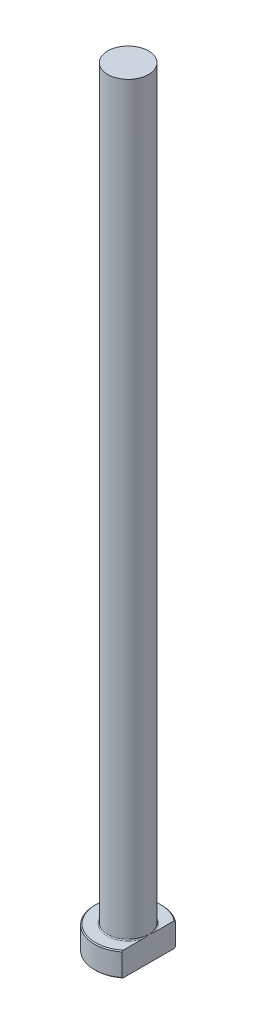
from build123d import *
from build123d.topology import SkipClean

# Parameters (mm, degrees)
CHAMFER1_SIZE = 0.2
FILLET1_R     = 0.2
KEY_DEPTH     = 161.305957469


with BuildPart() as part:
    # Sketch1 → Revolve1 (revolve)
    with BuildSketch(Plane.XY, mode=Mode.PRIVATE) as revolve1_sk:
        Polygon((0, 0), (-7, 0), (-7, 5), (-4.25, 5), (-4.25, 160), (0, 160), align=None)
    revolve(revolve1_sk.sketch.rotate(Axis((0, 259.958771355, 0), (0, -1, 0)), 270), axis=Axis((0, 259.958771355, 0), (0, -1, 0)))

    # Chamfer1
    chamfer1_edges = [part.edges().sort_by_distance(p)[0] for p in [
        (0, 5, -7),
        (0, 0, -7),
    ]]
    chamfer(chamfer1_edges, length=CHAMFER1_SIZE)

    # Fillet1
    fillet1_edges = [part.edges().sort_by_distance(p)[0] for p in [
        (0, 5, -4.25),
    ]]
    fillet(fillet1_edges, radius=FILLET1_R)

    # Sketch2 → KEY (cut, through all)
    with SkipClean():  # the faces are left unmerged after this step: merging them gives an invalid solid
        with BuildSketch(Plane(origin=(0, 0, 0), x_dir=(1, 0, 0), z_dir=(0, 1, 0))):
            with BuildLine():
                Line((4.25, 5.562148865), (4.25, -5.562148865))
                ThreePointArc((4.25, -5.562148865), (7, 0), (4.25, 5.562148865))
            make_face()
        extrude(amount=KEY_DEPTH, mode=Mode.SUBTRACT)


solid = part.part
